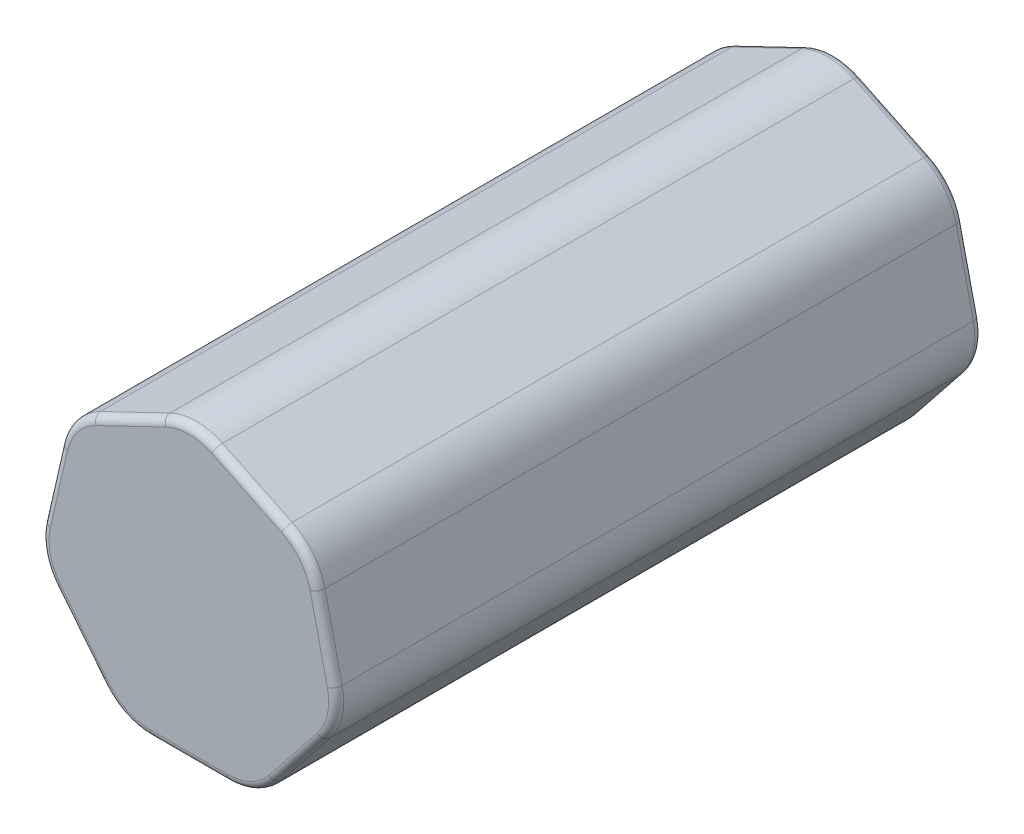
from build123d import *

# Parameters (mm, degrees)
BOSS_EXTRUDE1_DEPTH = 67.945
FILLET1_R           = 12.7
FILLET2_R           = 1.5875


with BuildPart() as part:
    # Sketch1 → Boss-Extrude1 (new, symmetric)
    with BuildSketch(Plane.XY):
        Polygon((25.678107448, 20.477607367), (0, 32.843532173), (-25.678107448, 20.477607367), (-32.02007625, -7.308373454), (-14.250274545, -29.591), (14.250274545, -29.591), (32.02007625, -7.308373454), align=None)
    extrude(amount=BOSS_EXTRUDE1_DEPTH, both=True)

    # Fillet1
    fillet1_edges = [part.edges().sort_by_distance(p)[0] for p in [
        (32.02007625, -7.308373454, 0),
        (14.250274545, -29.591, 0),
        (-14.250274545, -29.591, 0),
        (-32.02007625, -7.308373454, 0),
        (-25.678107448, 20.477607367, 0),
        (0, 32.843532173, 0),
        (25.678107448, 20.477607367, 0),
    ]]
    fillet(fillet1_edges, radius=FILLET1_R)

    # Fillet2
    fillet2_edges = [part.edges().sort_by_distance(p)[0] for p in [
        (-23.135175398, -18.449686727, -67.945),
        (-23.135175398, -18.449686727, 67.945),
        (28.849091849, 6.584616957, -67.945),
        (23.135175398, -18.449686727, -67.945),
        (0, -29.591, -67.945),
        (-28.849091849, 6.584616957, -67.945),
        (-12.839053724, 26.66056977, -67.945),
        (12.839053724, 26.66056977, -67.945),
        (-24.586720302, 19.607255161, -67.945),
        (0, 31.447595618, -67.945),
        (24.586720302, 19.607255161, -67.945),
        (30.659138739, -6.997748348, -67.945),
        (13.644600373, -28.333304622, -67.945),
        (-13.644600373, -28.333304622, -67.945),
        (-30.659138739, -6.997748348, -67.945),
        (-28.849091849, 6.584616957, 67.945),
        (28.849091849, 6.584616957, 67.945),
        (12.839053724, 26.66056977, 67.945),
        (-12.839053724, 26.66056977, 67.945),
        (0, -29.591, 67.945),
        (23.135175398, -18.449686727, 67.945),
        (-24.586720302, 19.607255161, 67.945),
        (0, 31.447595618, 67.945),
        (24.586720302, 19.607255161, 67.945),
        (30.659138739, -6.997748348, 67.945),
        (13.644600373, -28.333304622, 67.945),
        (-13.644600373, -28.333304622, 67.945),
        (-30.659138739, -6.997748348, 67.945),
    ]]
    fillet(fillet2_edges, radius=FILLET2_R)


solid = part.part
